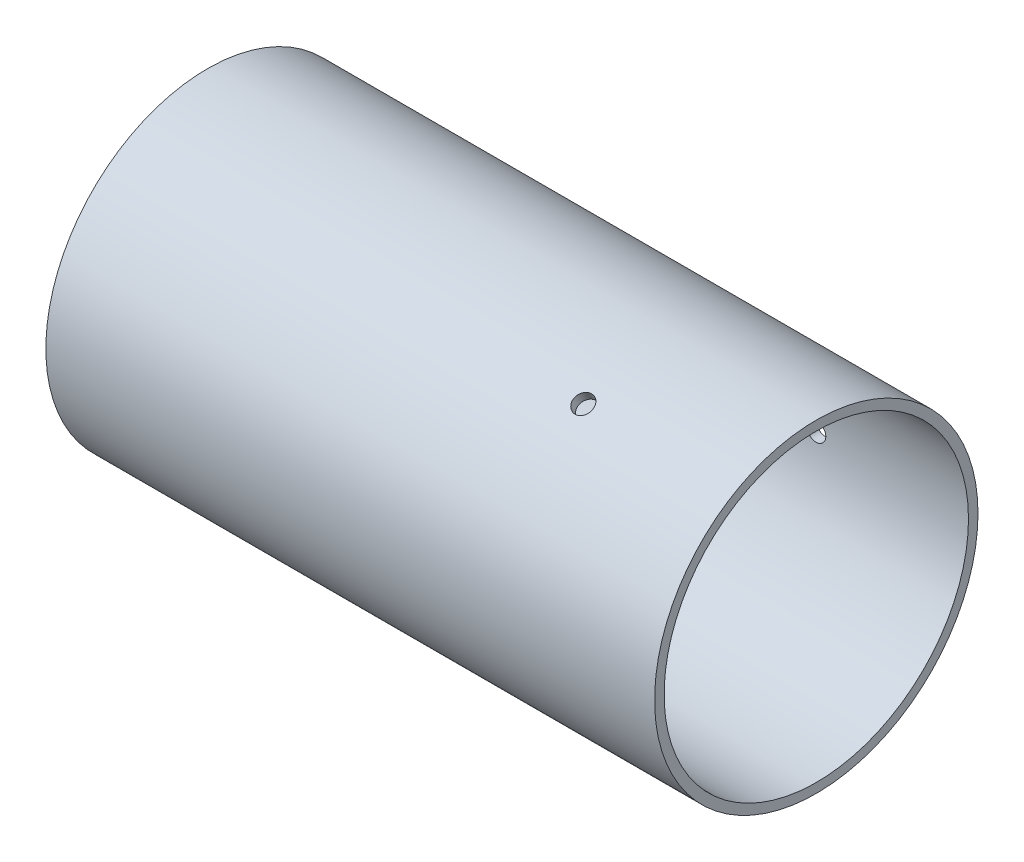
from build123d import *

# Parameters (mm, degrees)
SKETCH1_R          = 26.9875
SKETCH1_R_2        = 25.4
EXTRUDE1_DEPTH     = 101.6
SKETCH3_R          = 1.5875
CUT_EXTRUDE1_DEPTH = 109.532070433
SKETCH4_R          = 1.5875
CUT_EXTRUDE2_DEPTH = 109.532070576
SKETCH5_R          = 1.5875
CUT_EXTRUDE3_DEPTH = 109.532070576


with BuildPart() as part:
    # Sketch1 → Extrude1 (new body)
    with BuildSketch(Plane(origin=(0, 0, 0), x_dir=(0, 0, -1), z_dir=(1, 0, 0))):
        Circle(SKETCH1_R)
        Circle(SKETCH1_R_2, mode=Mode.SUBTRACT)
    extrude(amount=EXTRUDE1_DEPTH)

    # Sketch3 → Cut-Extrude1 (cut, through all)
    with BuildSketch(Plane.XY):
        with Locations((76.2, 0)):
            Circle(SKETCH3_R)
    extrude(amount=-CUT_EXTRUDE1_DEPTH, mode=Mode.SUBTRACT)

    # Sketch4 → Cut-Extrude2 (cut, through all)
    with BuildSketch(Plane(origin=(0, 0, 0), x_dir=(1, 0, 0), z_dir=(0, -0.8660254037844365, -0.500000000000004))):
        with Locations(Location((76.2, 0, 0), (0, 0, 270))):
            Circle(SKETCH4_R)
    extrude(amount=-CUT_EXTRUDE2_DEPTH, mode=Mode.SUBTRACT)

    # Sketch5 → Cut-Extrude3 (cut, through all)
    with BuildSketch(Plane(origin=(0, 0, 0), x_dir=(-1, 0, 0), z_dir=(0, 0.8660254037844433, -0.49999999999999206))):
        with Locations(Location((-76.2, 0, 0), (0, 0, 90))):
            Circle(SKETCH5_R)
    extrude(amount=-CUT_EXTRUDE3_DEPTH, mode=Mode.SUBTRACT)


solid = part.part
